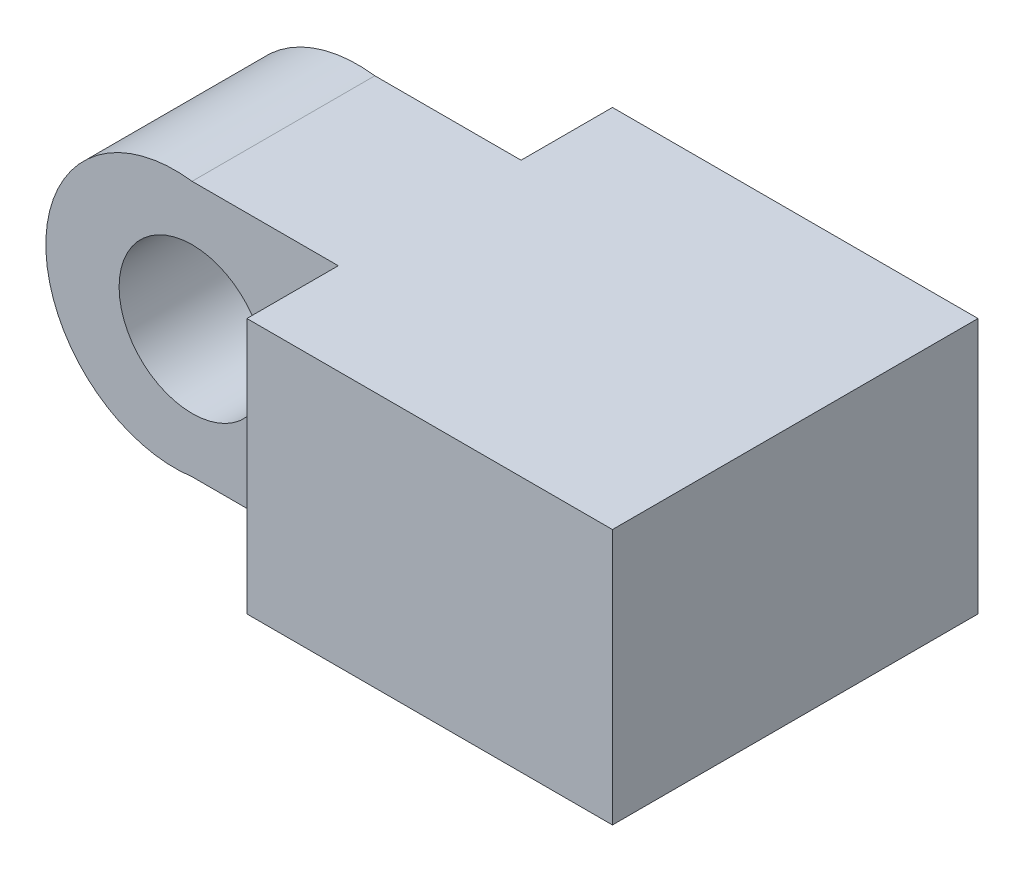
ISO-10303-21;
HEADER;
FILE_DESCRIPTION(('STEP AP214'),'2;1');
FILE_NAME('part.step','',(''),(''),'','','');
FILE_SCHEMA(('AUTOMOTIVE_DESIGN { 1 0 10303 214 1 1 1 1 }'));
ENDSEC;
DATA;
#1=APPLICATION_CONTEXT('core data for automotive mechanical design processes');
#2=APPLICATION_PROTOCOL_DEFINITION('international standard','automotive_design',2000,#1);
#3=PRODUCT_CONTEXT('',#1,'mechanical');
#4=PRODUCT('Part','Part','',(#3));
#5=PRODUCT_RELATED_PRODUCT_CATEGORY('part','',(#4));
#6=PRODUCT_DEFINITION_FORMATION('','',#4);
#7=PRODUCT_DEFINITION_CONTEXT('part definition',#1,'design');
#8=PRODUCT_DEFINITION('design','',#6,#7);
#9=PRODUCT_DEFINITION_SHAPE('','',#8);
#10=(LENGTH_UNIT() NAMED_UNIT(*) SI_UNIT(.MILLI.,.METRE.));
#11=(NAMED_UNIT(*) PLANE_ANGLE_UNIT() SI_UNIT($,.RADIAN.));
#12=(NAMED_UNIT(*) SI_UNIT($,.STERADIAN.) SOLID_ANGLE_UNIT());
#13=UNCERTAINTY_MEASURE_WITH_UNIT(LENGTH_MEASURE(1.E-05),#10,'distance_accuracy_value','');
#14=(GEOMETRIC_REPRESENTATION_CONTEXT(3) GLOBAL_UNCERTAINTY_ASSIGNED_CONTEXT((#13)) GLOBAL_UNIT_ASSIGNED_CONTEXT((#10,
#11,#12)) REPRESENTATION_CONTEXT('',''));
#15=CARTESIAN_POINT('',(0.,0.,0.));
#16=DIRECTION('',(0.,0.,1.));
#17=DIRECTION('',(1.,0.,0.));
#18=AXIS2_PLACEMENT_3D('',#15,#16,#17);
#19=CARTESIAN_POINT('',(0.,7.,0.));
#20=DIRECTION('',(0.,0.,-1.));
#21=DIRECTION('',(-1.,0.,0.));
#22=AXIS2_PLACEMENT_3D('',#19,#20,#21);
#23=PLANE('',#22);
#24=DIRECTION('',(1.,0.,0.));
#25=VECTOR('',#24,1.);
#26=CARTESIAN_POINT('',(0.,7.,0.));
#27=LINE('',#26,#25);
#28=CARTESIAN_POINT('',(0.,7.,0.));
#29=VERTEX_POINT('',#28);
#30=CARTESIAN_POINT('',(10.,7.,0.));
#31=VERTEX_POINT('',#30);
#32=EDGE_CURVE('E93',#29,#31,#27,.T.);
#33=ORIENTED_EDGE('',*,*,#32,.F.);
#34=DIRECTION('',(0.,1.,0.));
#35=VECTOR('',#34,1.);
#36=CARTESIAN_POINT('',(0.,-0.03125,0.));
#37=LINE('',#36,#35);
#38=CARTESIAN_POINT('',(0.,0.,0.));
#39=VERTEX_POINT('',#38);
#40=EDGE_CURVE('E103',#39,#29,#37,.T.);
#41=ORIENTED_EDGE('',*,*,#40,.F.);
#42=DIRECTION('',(1.,0.,0.));
#43=VECTOR('',#42,1.);
#44=CARTESIAN_POINT('',(0.,0.,0.));
#45=LINE('',#44,#43);
#46=CARTESIAN_POINT('',(10.,0.,0.));
#47=VERTEX_POINT('',#46);
#48=EDGE_CURVE('E80',#39,#47,#45,.T.);
#49=ORIENTED_EDGE('',*,*,#48,.T.);
#50=DIRECTION('',(0.,-1.,0.));
#51=VECTOR('',#50,1.);
#52=CARTESIAN_POINT('',(10.,7.,0.));
#53=LINE('',#52,#51);
#54=EDGE_CURVE('E75',#31,#47,#53,.T.);
#55=ORIENTED_EDGE('',*,*,#54,.F.);
#56=EDGE_LOOP('',(#33,#41,#49,#55));
#57=FACE_BOUND('',#56,.T.);
#58=ADVANCED_FACE('F33',(#57),#23,.F.);
#59=CARTESIAN_POINT('',(10.,7.,0.));
#60=DIRECTION('',(-1.,0.,0.));
#61=DIRECTION('',(0.,0.,1.));
#62=AXIS2_PLACEMENT_3D('',#59,#60,#61);
#63=PLANE('',#62);
#64=DIRECTION('',(0.,0.,-1.));
#65=VECTOR('',#64,1.);
#66=CARTESIAN_POINT('',(10.,0.,0.));
#67=LINE('',#66,#65);
#68=CARTESIAN_POINT('',(10.,0.,-10.));
#69=VERTEX_POINT('',#68);
#70=EDGE_CURVE('E69',#47,#69,#67,.T.);
#71=ORIENTED_EDGE('',*,*,#70,.T.);
#72=DIRECTION('',(0.,-1.,0.));
#73=VECTOR('',#72,1.);
#74=CARTESIAN_POINT('',(10.,7.,-10.));
#75=LINE('',#74,#73);
#76=CARTESIAN_POINT('',(10.,7.,-10.));
#77=VERTEX_POINT('',#76);
#78=EDGE_CURVE('E72',#77,#69,#75,.T.);
#79=ORIENTED_EDGE('',*,*,#78,.F.);
#80=DIRECTION('',(0.,0.,-1.));
#81=VECTOR('',#80,1.);
#82=CARTESIAN_POINT('',(10.,7.,0.));
#83=LINE('',#82,#81);
#84=EDGE_CURVE('E56',#31,#77,#83,.T.);
#85=ORIENTED_EDGE('',*,*,#84,.F.);
#86=ORIENTED_EDGE('',*,*,#54,.T.);
#87=EDGE_LOOP('',(#71,#79,#85,#86));
#88=FACE_BOUND('',#87,.T.);
#89=ADVANCED_FACE('F71',(#88),#63,.F.);
#90=CARTESIAN_POINT('',(0.,7.,-10.));
#91=DIRECTION('',(0.,0.,1.));
#92=DIRECTION('',(1.,0.,0.));
#93=AXIS2_PLACEMENT_3D('',#90,#91,#92);
#94=PLANE('',#93);
#95=DIRECTION('',(-1.,0.,0.));
#96=VECTOR('',#95,1.);
#97=CARTESIAN_POINT('',(0.,0.,-10.));
#98=LINE('',#97,#96);
#99=CARTESIAN_POINT('',(0.,0.,-10.));
#100=VERTEX_POINT('',#99);
#101=EDGE_CURVE('E79',#69,#100,#98,.T.);
#102=ORIENTED_EDGE('',*,*,#101,.T.);
#103=DIRECTION('',(0.,1.,0.));
#104=VECTOR('',#103,1.);
#105=CARTESIAN_POINT('',(0.,-0.03125,-10.));
#106=LINE('',#105,#104);
#107=CARTESIAN_POINT('',(0.,7.,-10.));
#108=VERTEX_POINT('',#107);
#109=EDGE_CURVE('E117',#100,#108,#106,.T.);
#110=ORIENTED_EDGE('',*,*,#109,.T.);
#111=DIRECTION('',(-1.,0.,0.));
#112=VECTOR('',#111,1.);
#113=CARTESIAN_POINT('',(0.,7.,-10.));
#114=LINE('',#113,#112);
#115=EDGE_CURVE('E87',#77,#108,#114,.T.);
#116=ORIENTED_EDGE('',*,*,#115,.F.);
#117=ORIENTED_EDGE('',*,*,#78,.T.);
#118=EDGE_LOOP('',(#102,#110,#116,#117));
#119=FACE_BOUND('',#118,.T.);
#120=ADVANCED_FACE('F84',(#119),#94,.F.);
#121=CARTESIAN_POINT('',(0.,7.,0.));
#122=DIRECTION('',(0.,-1.,0.));
#123=DIRECTION('',(0.,0.,-1.));
#124=AXIS2_PLACEMENT_3D('',#121,#122,#123);
#125=PLANE('',#124);
#126=DIRECTION('',(1.,0.,0.));
#127=VECTOR('',#126,1.);
#128=CARTESIAN_POINT('',(0.,7.,-2.5));
#129=LINE('',#128,#127);
#130=CARTESIAN_POINT('',(-4.,7.,-2.5));
#131=VERTEX_POINT('',#130);
#132=CARTESIAN_POINT('',(0.,7.,-2.5));
#133=VERTEX_POINT('',#132);
#134=EDGE_CURVE('E139',#131,#133,#129,.T.);
#135=ORIENTED_EDGE('',*,*,#134,.T.);
#136=DIRECTION('',(0.,0.,1.));
#137=VECTOR('',#136,1.);
#138=CARTESIAN_POINT('',(0.,7.,0.));
#139=LINE('',#138,#137);
#140=EDGE_CURVE('E144',#133,#29,#139,.T.);
#141=ORIENTED_EDGE('',*,*,#140,.T.);
#142=ORIENTED_EDGE('',*,*,#32,.T.);
#143=ORIENTED_EDGE('',*,*,#84,.T.);
#144=ORIENTED_EDGE('',*,*,#115,.T.);
#145=DIRECTION('',(0.,0.,1.));
#146=VECTOR('',#145,1.);
#147=CARTESIAN_POINT('',(0.,7.,0.));
#148=LINE('',#147,#146);
#149=CARTESIAN_POINT('',(0.,7.,-7.5));
#150=VERTEX_POINT('',#149);
#151=EDGE_CURVE('E142',#108,#150,#148,.T.);
#152=ORIENTED_EDGE('',*,*,#151,.T.);
#153=DIRECTION('',(-1.,0.,0.));
#154=VECTOR('',#153,1.);
#155=CARTESIAN_POINT('',(0.,7.,-7.5));
#156=LINE('',#155,#154);
#157=CARTESIAN_POINT('',(-4.,7.,-7.5));
#158=VERTEX_POINT('',#157);
#159=EDGE_CURVE('E107',#150,#158,#156,.T.);
#160=ORIENTED_EDGE('',*,*,#159,.T.);
#161=DIRECTION('',(0.,0.,1.));
#162=VECTOR('',#161,1.);
#163=CARTESIAN_POINT('',(-4.,7.,-10.));
#164=LINE('',#163,#162);
#165=EDGE_CURVE('E147',#158,#131,#164,.T.);
#166=ORIENTED_EDGE('',*,*,#165,.T.);
#167=EDGE_LOOP('',(#135,#141,#142,#143,#144,#152,#160,#166));
#168=FACE_BOUND('',#167,.T.);
#169=ADVANCED_FACE('F175',(#168),#125,.F.);
#170=CARTESIAN_POINT('',(0.,0.,0.));
#171=DIRECTION('',(0.,-1.,0.));
#172=DIRECTION('',(0.,0.,-1.));
#173=AXIS2_PLACEMENT_3D('',#170,#171,#172);
#174=PLANE('',#173);
#175=DIRECTION('',(0.,0.,1.));
#176=VECTOR('',#175,1.);
#177=CARTESIAN_POINT('',(0.,0.,0.));
#178=LINE('',#177,#176);
#179=CARTESIAN_POINT('',(0.,0.,-2.5));
#180=VERTEX_POINT('',#179);
#181=EDGE_CURVE('E11',#180,#39,#178,.T.);
#182=ORIENTED_EDGE('',*,*,#181,.F.);
#183=DIRECTION('',(1.,0.,0.));
#184=VECTOR('',#183,1.);
#185=CARTESIAN_POINT('',(0.,0.,-2.5));
#186=LINE('',#185,#184);
#187=CARTESIAN_POINT('',(-4.,0.,-2.5));
#188=VERTEX_POINT('',#187);
#189=EDGE_CURVE('E136',#188,#180,#186,.T.);
#190=ORIENTED_EDGE('',*,*,#189,.F.);
#191=DIRECTION('',(0.,0.,1.));
#192=VECTOR('',#191,1.);
#193=CARTESIAN_POINT('',(-4.,0.,-10.));
#194=LINE('',#193,#192);
#195=CARTESIAN_POINT('',(-4.,0.,-7.5));
#196=VERTEX_POINT('',#195);
#197=EDGE_CURVE('E128',#196,#188,#194,.T.);
#198=ORIENTED_EDGE('',*,*,#197,.F.);
#199=DIRECTION('',(-1.,0.,0.));
#200=VECTOR('',#199,1.);
#201=CARTESIAN_POINT('',(0.,0.,-7.5));
#202=LINE('',#201,#200);
#203=CARTESIAN_POINT('',(0.,0.,-7.5));
#204=VERTEX_POINT('',#203);
#205=EDGE_CURVE('E47',#204,#196,#202,.T.);
#206=ORIENTED_EDGE('',*,*,#205,.F.);
#207=DIRECTION('',(0.,0.,1.));
#208=VECTOR('',#207,1.);
#209=CARTESIAN_POINT('',(0.,0.,0.));
#210=LINE('',#209,#208);
#211=EDGE_CURVE('E40',#100,#204,#210,.T.);
#212=ORIENTED_EDGE('',*,*,#211,.F.);
#213=ORIENTED_EDGE('',*,*,#101,.F.);
#214=ORIENTED_EDGE('',*,*,#70,.F.);
#215=ORIENTED_EDGE('',*,*,#48,.F.);
#216=EDGE_LOOP('',(#182,#190,#198,#206,#212,#213,#214,#215));
#217=FACE_BOUND('',#216,.T.);
#218=ADVANCED_FACE('F91',(#217),#174,.T.);
#219=CARTESIAN_POINT('',(-4.46875,3.5,-10.));
#220=DIRECTION('',(0.,0.,1.));
#221=DIRECTION('',(1.,0.,0.));
#222=AXIS2_PLACEMENT_3D('',#219,#220,#221);
#223=CYLINDRICAL_SURFACE('',#222,3.53125);
#224=CARTESIAN_POINT('',(-4.46875,3.5,-2.5));
#225=DIRECTION('',(0.,0.,-1.));
#226=DIRECTION('',(-1.,0.,0.));
#227=AXIS2_PLACEMENT_3D('',#224,#225,#226);
#228=CIRCLE('',#227,3.53125);
#229=EDGE_CURVE('E106',#131,#188,#228,.F.);
#230=ORIENTED_EDGE('',*,*,#229,.F.);
#231=ORIENTED_EDGE('',*,*,#165,.F.);
#232=CARTESIAN_POINT('',(-4.46875,3.5,-7.5));
#233=DIRECTION('',(0.,0.,1.));
#234=DIRECTION('',(1.,0.,0.));
#235=AXIS2_PLACEMENT_3D('',#232,#233,#234);
#236=CIRCLE('',#235,3.53125);
#237=EDGE_CURVE('E102',#196,#158,#236,.F.);
#238=ORIENTED_EDGE('',*,*,#237,.F.);
#239=ORIENTED_EDGE('',*,*,#197,.T.);
#240=EDGE_LOOP('',(#230,#231,#238,#239));
#241=FACE_BOUND('',#240,.T.);
#242=ADVANCED_FACE('F183',(#241),#223,.T.);
#243=CARTESIAN_POINT('',(0.,-0.03125,-10.));
#244=DIRECTION('',(1.,0.,0.));
#245=DIRECTION('',(0.,0.,-1.));
#246=AXIS2_PLACEMENT_3D('',#243,#244,#245);
#247=PLANE('',#246);
#248=ORIENTED_EDGE('',*,*,#109,.F.);
#249=ORIENTED_EDGE('',*,*,#211,.T.);
#250=DIRECTION('',(0.,1.,0.));
#251=VECTOR('',#250,1.);
#252=CARTESIAN_POINT('',(0.,-0.03125,-7.5));
#253=LINE('',#252,#251);
#254=EDGE_CURVE('E115',#204,#150,#253,.T.);
#255=ORIENTED_EDGE('',*,*,#254,.T.);
#256=ORIENTED_EDGE('',*,*,#151,.F.);
#257=EDGE_LOOP('',(#248,#249,#255,#256));
#258=FACE_BOUND('',#257,.T.);
#259=ADVANCED_FACE('F112',(#258),#247,.F.);
#260=CARTESIAN_POINT('',(0.,-0.03125,-7.5));
#261=DIRECTION('',(0.,0.,1.));
#262=DIRECTION('',(1.,0.,0.));
#263=AXIS2_PLACEMENT_3D('',#260,#261,#262);
#264=PLANE('',#263);
#265=CARTESIAN_POINT('',(-3.9963175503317,3.5,-7.5));
#266=DIRECTION('',(0.,0.,1.));
#267=DIRECTION('',(1.,0.,0.));
#268=AXIS2_PLACEMENT_3D('',#265,#266,#267);
#269=CIRCLE('',#268,2.);
#270=CARTESIAN_POINT('',(-1.9963175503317,3.5,-7.5));
#271=VERTEX_POINT('',#270);
#272=EDGE_CURVE('E99',#271,#271,#269,.F.);
#273=ORIENTED_EDGE('',*,*,#272,.F.);
#274=EDGE_LOOP('',(#273));
#275=FACE_BOUND('',#274,.T.);
#276=ORIENTED_EDGE('',*,*,#254,.F.);
#277=ORIENTED_EDGE('',*,*,#205,.T.);
#278=ORIENTED_EDGE('',*,*,#237,.T.);
#279=ORIENTED_EDGE('',*,*,#159,.F.);
#280=EDGE_LOOP('',(#276,#277,#278,#279));
#281=FACE_BOUND('',#280,.T.);
#282=ADVANCED_FACE('F121',(#275,#281),#264,.F.);
#283=CARTESIAN_POINT('',(0.,-0.03125,0.));
#284=DIRECTION('',(1.,0.,0.));
#285=DIRECTION('',(0.,0.,-1.));
#286=AXIS2_PLACEMENT_3D('',#283,#284,#285);
#287=PLANE('',#286);
#288=DIRECTION('',(0.,1.,0.));
#289=VECTOR('',#288,1.);
#290=CARTESIAN_POINT('',(0.,-0.03125,-2.5));
#291=LINE('',#290,#289);
#292=EDGE_CURVE('E123',#180,#133,#291,.T.);
#293=ORIENTED_EDGE('',*,*,#292,.F.);
#294=ORIENTED_EDGE('',*,*,#181,.T.);
#295=ORIENTED_EDGE('',*,*,#40,.T.);
#296=ORIENTED_EDGE('',*,*,#140,.F.);
#297=EDGE_LOOP('',(#293,#294,#295,#296));
#298=FACE_BOUND('',#297,.T.);
#299=ADVANCED_FACE('F238',(#298),#287,.F.);
#300=CARTESIAN_POINT('',(0.,-0.03125,-2.5));
#301=DIRECTION('',(0.,0.,-1.));
#302=DIRECTION('',(-1.,0.,0.));
#303=AXIS2_PLACEMENT_3D('',#300,#301,#302);
#304=PLANE('',#303);
#305=CARTESIAN_POINT('',(-3.9963175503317,3.5,-2.5));
#306=DIRECTION('',(0.,0.,-1.));
#307=DIRECTION('',(-1.,0.,0.));
#308=AXIS2_PLACEMENT_3D('',#305,#306,#307);
#309=CIRCLE('',#308,2.);
#310=CARTESIAN_POINT('',(-5.9963175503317,3.5,-2.5));
#311=VERTEX_POINT('',#310);
#312=EDGE_CURVE('E104',#311,#311,#309,.F.);
#313=ORIENTED_EDGE('',*,*,#312,.F.);
#314=EDGE_LOOP('',(#313));
#315=FACE_BOUND('',#314,.T.);
#316=ORIENTED_EDGE('',*,*,#134,.F.);
#317=ORIENTED_EDGE('',*,*,#229,.T.);
#318=ORIENTED_EDGE('',*,*,#189,.T.);
#319=ORIENTED_EDGE('',*,*,#292,.T.);
#320=EDGE_LOOP('',(#316,#317,#318,#319));
#321=FACE_BOUND('',#320,.T.);
#322=ADVANCED_FACE('F248',(#315,#321),#304,.F.);
#323=CARTESIAN_POINT('',(-3.9963175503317,3.5,-10.));
#324=DIRECTION('',(0.,0.,1.));
#325=DIRECTION('',(1.,0.,0.));
#326=AXIS2_PLACEMENT_3D('',#323,#324,#325);
#327=CYLINDRICAL_SURFACE('',#326,2.);
#328=ORIENTED_EDGE('',*,*,#312,.T.);
#329=EDGE_LOOP('',(#328));
#330=FACE_BOUND('',#329,.T.);
#331=ORIENTED_EDGE('',*,*,#272,.T.);
#332=EDGE_LOOP('',(#331));
#333=FACE_BOUND('',#332,.T.);
#334=ADVANCED_FACE('F257',(#330,#333),#327,.F.);
#335=CLOSED_SHELL('',(#58,#89,#120,#169,#218,#242,#259,#282,#299,#322,#334));
#336=MANIFOLD_SOLID_BREP('B2',#335);
#337=ADVANCED_BREP_SHAPE_REPRESENTATION('',(#18,#336),#14);
#338=SHAPE_DEFINITION_REPRESENTATION(#9,#337);
ENDSEC;
END-ISO-10303-21;
